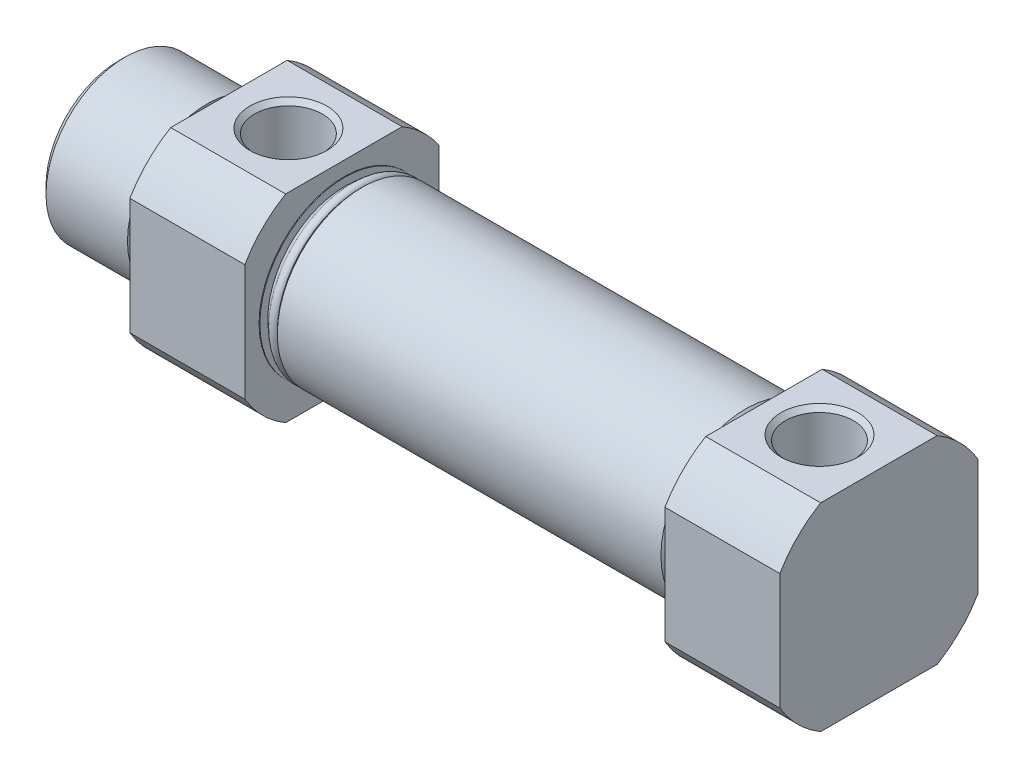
ISO-10303-21;
HEADER;
FILE_DESCRIPTION(('STEP AP214'),'2;1');
FILE_NAME('part.step','',(''),(''),'','','');
FILE_SCHEMA(('AUTOMOTIVE_DESIGN { 1 0 10303 214 1 1 1 1 }'));
ENDSEC;
DATA;
#1=APPLICATION_CONTEXT('core data for automotive mechanical design processes');
#2=APPLICATION_PROTOCOL_DEFINITION('international standard','automotive_design',2000,#1);
#3=PRODUCT_CONTEXT('',#1,'mechanical');
#4=PRODUCT('Part','Part','',(#3));
#5=PRODUCT_RELATED_PRODUCT_CATEGORY('part','',(#4));
#6=PRODUCT_DEFINITION_FORMATION('','',#4);
#7=PRODUCT_DEFINITION_CONTEXT('part definition',#1,'design');
#8=PRODUCT_DEFINITION('design','',#6,#7);
#9=PRODUCT_DEFINITION_SHAPE('','',#8);
#10=(LENGTH_UNIT() NAMED_UNIT(*) SI_UNIT(.MILLI.,.METRE.));
#11=(NAMED_UNIT(*) PLANE_ANGLE_UNIT() SI_UNIT($,.RADIAN.));
#12=(NAMED_UNIT(*) SI_UNIT($,.STERADIAN.) SOLID_ANGLE_UNIT());
#13=UNCERTAINTY_MEASURE_WITH_UNIT(LENGTH_MEASURE(1.E-05),#10,'distance_accuracy_value','');
#14=(GEOMETRIC_REPRESENTATION_CONTEXT(3) GLOBAL_UNCERTAINTY_ASSIGNED_CONTEXT((#13)) GLOBAL_UNIT_ASSIGNED_CONTEXT((#10,
#11,#12)) REPRESENTATION_CONTEXT('',''));
#15=CARTESIAN_POINT('',(0.,0.,0.));
#16=DIRECTION('',(0.,0.,1.));
#17=DIRECTION('',(1.,0.,0.));
#18=AXIS2_PLACEMENT_3D('',#15,#16,#17);
#19=CARTESIAN_POINT('',(67.5,10.7,0.));
#20=DIRECTION('',(1.,0.,0.));
#21=DIRECTION('',(0.,0.,-1.));
#22=AXIS2_PLACEMENT_3D('',#19,#20,#21);
#23=PLANE('',#22);
#24=CARTESIAN_POINT('',(67.5,0.,0.));
#25=DIRECTION('',(-1.,0.,0.));
#26=DIRECTION('',(0.,0.,1.));
#27=AXIS2_PLACEMENT_3D('',#24,#25,#26);
#28=CIRCLE('',#27,10.7);
#29=CARTESIAN_POINT('',(67.5,0.,10.7));
#30=VERTEX_POINT('',#29);
#31=EDGE_CURVE('E230',#30,#30,#28,.T.);
#32=ORIENTED_EDGE('',*,*,#31,.F.);
#33=EDGE_LOOP('',(#32));
#34=FACE_BOUND('',#33,.T.);
#35=DIRECTION('',(0.,0.,1.));
#36=VECTOR('',#35,1.);
#37=CARTESIAN_POINT('',(67.5,12.5,-7.34846922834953));
#38=LINE('',#37,#36);
#39=CARTESIAN_POINT('',(67.5,12.5,-7.34846922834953));
#40=VERTEX_POINT('',#39);
#41=CARTESIAN_POINT('',(67.5,12.5,7.34846922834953));
#42=VERTEX_POINT('',#41);
#43=EDGE_CURVE('E339',#40,#42,#38,.T.);
#44=ORIENTED_EDGE('',*,*,#43,.F.);
#45=CARTESIAN_POINT('',(67.5,0.,0.));
#46=DIRECTION('',(-1.,0.,0.));
#47=DIRECTION('',(0.,0.,1.));
#48=AXIS2_PLACEMENT_3D('',#45,#46,#47);
#49=CIRCLE('',#48,14.5);
#50=CARTESIAN_POINT('',(67.5,7.34846922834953,-12.5));
#51=VERTEX_POINT('',#50);
#52=EDGE_CURVE('E231',#40,#51,#49,.T.);
#53=ORIENTED_EDGE('',*,*,#52,.T.);
#54=DIRECTION('',(0.,1.,0.));
#55=VECTOR('',#54,1.);
#56=CARTESIAN_POINT('',(67.5,-7.34846922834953,-12.5));
#57=LINE('',#56,#55);
#58=CARTESIAN_POINT('',(67.5,-7.34846922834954,-12.5));
#59=VERTEX_POINT('',#58);
#60=EDGE_CURVE('E347',#59,#51,#57,.T.);
#61=ORIENTED_EDGE('',*,*,#60,.F.);
#62=CARTESIAN_POINT('',(67.5,-12.5,-7.34846922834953));
#63=VERTEX_POINT('',#62);
#64=EDGE_CURVE('E356',#59,#63,#49,.T.);
#65=ORIENTED_EDGE('',*,*,#64,.T.);
#66=DIRECTION('',(0.,0.,-1.));
#67=VECTOR('',#66,1.);
#68=CARTESIAN_POINT('',(67.5,-12.5,7.34846922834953));
#69=LINE('',#68,#67);
#70=CARTESIAN_POINT('',(67.5,-12.5,7.34846922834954));
#71=VERTEX_POINT('',#70);
#72=EDGE_CURVE('E363',#71,#63,#69,.T.);
#73=ORIENTED_EDGE('',*,*,#72,.F.);
#74=CARTESIAN_POINT('',(67.5,-7.34846922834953,12.5));
#75=VERTEX_POINT('',#74);
#76=EDGE_CURVE('E225',#71,#75,#49,.T.);
#77=ORIENTED_EDGE('',*,*,#76,.T.);
#78=DIRECTION('',(0.,-1.,0.));
#79=VECTOR('',#78,1.);
#80=CARTESIAN_POINT('',(67.5,7.34846922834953,12.5));
#81=LINE('',#80,#79);
#82=CARTESIAN_POINT('',(67.5,7.34846922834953,12.5));
#83=VERTEX_POINT('',#82);
#84=EDGE_CURVE('E362',#83,#75,#81,.T.);
#85=ORIENTED_EDGE('',*,*,#84,.F.);
#86=EDGE_CURVE('E227',#83,#42,#49,.T.);
#87=ORIENTED_EDGE('',*,*,#86,.T.);
#88=EDGE_LOOP('',(#44,#53,#61,#65,#73,#77,#85,#87));
#89=FACE_BOUND('',#88,.T.);
#90=ADVANCED_FACE('F16',(#34,#89),#23,.F.);
#91=CARTESIAN_POINT('',(82.,0.,0.));
#92=DIRECTION('',(-1.,0.,0.));
#93=DIRECTION('',(0.,0.,1.));
#94=AXIS2_PLACEMENT_3D('',#91,#92,#93);
#95=CYLINDRICAL_SURFACE('',#94,14.5);
#96=DIRECTION('',(1.,0.,0.));
#97=VECTOR('',#96,1.);
#98=CARTESIAN_POINT('',(67.5,12.5,-7.34846922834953));
#99=LINE('',#98,#97);
#100=CARTESIAN_POINT('',(82.,12.5,-7.34846922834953));
#101=VERTEX_POINT('',#100);
#102=EDGE_CURVE('E353',#40,#101,#99,.T.);
#103=ORIENTED_EDGE('',*,*,#102,.T.);
#104=CARTESIAN_POINT('',(82.,0.,0.));
#105=DIRECTION('',(-1.,0.,0.));
#106=DIRECTION('',(0.,0.,1.));
#107=AXIS2_PLACEMENT_3D('',#104,#105,#106);
#108=CIRCLE('',#107,14.5);
#109=CARTESIAN_POINT('',(82.,7.34846922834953,-12.5));
#110=VERTEX_POINT('',#109);
#111=EDGE_CURVE('E226',#101,#110,#108,.T.);
#112=ORIENTED_EDGE('',*,*,#111,.T.);
#113=DIRECTION('',(1.,0.,0.));
#114=VECTOR('',#113,1.);
#115=CARTESIAN_POINT('',(67.5,7.34846922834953,-12.5));
#116=LINE('',#115,#114);
#117=EDGE_CURVE('E355',#51,#110,#116,.T.);
#118=ORIENTED_EDGE('',*,*,#117,.F.);
#119=ORIENTED_EDGE('',*,*,#52,.F.);
#120=EDGE_LOOP('',(#103,#112,#118,#119));
#121=FACE_BOUND('',#120,.T.);
#122=ADVANCED_FACE('F335',(#121),#95,.T.);
#123=DIRECTION('',(1.,0.,0.));
#124=VECTOR('',#123,1.);
#125=CARTESIAN_POINT('',(67.5,12.5,7.34846922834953));
#126=LINE('',#125,#124);
#127=CARTESIAN_POINT('',(82.,12.5,7.34846922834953));
#128=VERTEX_POINT('',#127);
#129=EDGE_CURVE('E381',#42,#128,#126,.T.);
#130=ORIENTED_EDGE('',*,*,#129,.F.);
#131=ORIENTED_EDGE('',*,*,#86,.F.);
#132=DIRECTION('',(1.,0.,0.));
#133=VECTOR('',#132,1.);
#134=CARTESIAN_POINT('',(67.5,7.34846922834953,12.5));
#135=LINE('',#134,#133);
#136=CARTESIAN_POINT('',(82.,7.34846922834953,12.5));
#137=VERTEX_POINT('',#136);
#138=EDGE_CURVE('E346',#83,#137,#135,.T.);
#139=ORIENTED_EDGE('',*,*,#138,.T.);
#140=EDGE_CURVE('E222',#137,#128,#108,.T.);
#141=ORIENTED_EDGE('',*,*,#140,.T.);
#142=EDGE_LOOP('',(#130,#131,#139,#141));
#143=FACE_BOUND('',#142,.T.);
#144=ADVANCED_FACE('F503',(#143),#95,.T.);
#145=DIRECTION('',(1.,0.,0.));
#146=VECTOR('',#145,1.);
#147=CARTESIAN_POINT('',(67.5,-7.34846922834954,-12.5));
#148=LINE('',#147,#146);
#149=CARTESIAN_POINT('',(82.,-7.34846922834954,-12.5));
#150=VERTEX_POINT('',#149);
#151=EDGE_CURVE('E391',#59,#150,#148,.T.);
#152=ORIENTED_EDGE('',*,*,#151,.T.);
#153=CARTESIAN_POINT('',(82.,-12.5,-7.34846922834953));
#154=VERTEX_POINT('',#153);
#155=EDGE_CURVE('E404',#150,#154,#108,.T.);
#156=ORIENTED_EDGE('',*,*,#155,.T.);
#157=DIRECTION('',(1.,0.,0.));
#158=VECTOR('',#157,1.);
#159=CARTESIAN_POINT('',(67.5,-12.5,-7.34846922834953));
#160=LINE('',#159,#158);
#161=EDGE_CURVE('E371',#63,#154,#160,.T.);
#162=ORIENTED_EDGE('',*,*,#161,.F.);
#163=ORIENTED_EDGE('',*,*,#64,.F.);
#164=EDGE_LOOP('',(#152,#156,#162,#163));
#165=FACE_BOUND('',#164,.T.);
#166=ADVANCED_FACE('F408',(#165),#95,.T.);
#167=DIRECTION('',(1.,0.,0.));
#168=VECTOR('',#167,1.);
#169=CARTESIAN_POINT('',(67.5,-12.5,7.34846922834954));
#170=LINE('',#169,#168);
#171=CARTESIAN_POINT('',(82.,-12.5,7.34846922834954));
#172=VERTEX_POINT('',#171);
#173=EDGE_CURVE('E368',#71,#172,#170,.T.);
#174=ORIENTED_EDGE('',*,*,#173,.T.);
#175=CARTESIAN_POINT('',(82.,-7.34846922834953,12.5));
#176=VERTEX_POINT('',#175);
#177=EDGE_CURVE('E221',#172,#176,#108,.T.);
#178=ORIENTED_EDGE('',*,*,#177,.T.);
#179=DIRECTION('',(1.,0.,0.));
#180=VECTOR('',#179,1.);
#181=CARTESIAN_POINT('',(67.5,-7.34846922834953,12.5));
#182=LINE('',#181,#180);
#183=EDGE_CURVE('E38',#75,#176,#182,.T.);
#184=ORIENTED_EDGE('',*,*,#183,.F.);
#185=ORIENTED_EDGE('',*,*,#76,.F.);
#186=EDGE_LOOP('',(#174,#178,#184,#185));
#187=FACE_BOUND('',#186,.T.);
#188=ADVANCED_FACE('F366',(#187),#95,.T.);
#189=CARTESIAN_POINT('',(82.,14.5,0.));
#190=DIRECTION('',(-1.,0.,0.));
#191=DIRECTION('',(0.,0.,1.));
#192=AXIS2_PLACEMENT_3D('',#189,#190,#191);
#193=PLANE('',#192);
#194=DIRECTION('',(0.,0.,1.));
#195=VECTOR('',#194,1.);
#196=CARTESIAN_POINT('',(82.,12.5,-7.34846922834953));
#197=LINE('',#196,#195);
#198=EDGE_CURVE('E387',#101,#128,#197,.T.);
#199=ORIENTED_EDGE('',*,*,#198,.T.);
#200=ORIENTED_EDGE('',*,*,#140,.F.);
#201=DIRECTION('',(0.,-1.,0.));
#202=VECTOR('',#201,1.);
#203=CARTESIAN_POINT('',(82.,7.34846922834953,12.5));
#204=LINE('',#203,#202);
#205=EDGE_CURVE('E406',#137,#176,#204,.T.);
#206=ORIENTED_EDGE('',*,*,#205,.T.);
#207=ORIENTED_EDGE('',*,*,#177,.F.);
#208=DIRECTION('',(0.,0.,-1.));
#209=VECTOR('',#208,1.);
#210=CARTESIAN_POINT('',(82.,-12.5,7.34846922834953));
#211=LINE('',#210,#209);
#212=EDGE_CURVE('E397',#172,#154,#211,.T.);
#213=ORIENTED_EDGE('',*,*,#212,.T.);
#214=ORIENTED_EDGE('',*,*,#155,.F.);
#215=DIRECTION('',(0.,1.,0.));
#216=VECTOR('',#215,1.);
#217=CARTESIAN_POINT('',(82.,-7.34846922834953,-12.5));
#218=LINE('',#217,#216);
#219=EDGE_CURVE('E405',#150,#110,#218,.T.);
#220=ORIENTED_EDGE('',*,*,#219,.T.);
#221=ORIENTED_EDGE('',*,*,#111,.F.);
#222=EDGE_LOOP('',(#199,#200,#206,#207,#213,#214,#220,#221));
#223=FACE_BOUND('',#222,.T.);
#224=ADVANCED_FACE('F402',(#223),#193,.F.);
#225=CARTESIAN_POINT('',(82.,0.,0.));
#226=DIRECTION('',(-1.,0.,0.));
#227=DIRECTION('',(0.,0.,1.));
#228=AXIS2_PLACEMENT_3D('',#225,#226,#227);
#229=CYLINDRICAL_SURFACE('',#228,14.5);
#230=CARTESIAN_POINT('',(14.5,0.,0.));
#231=DIRECTION('',(-1.,0.,0.));
#232=DIRECTION('',(0.,0.,1.));
#233=AXIS2_PLACEMENT_3D('',#230,#231,#232);
#234=CIRCLE('',#233,14.5);
#235=CARTESIAN_POINT('',(14.5,-12.5,7.34846922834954));
#236=VERTEX_POINT('',#235);
#237=CARTESIAN_POINT('',(14.5,-7.34846922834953,12.5));
#238=VERTEX_POINT('',#237);
#239=EDGE_CURVE('E157',#236,#238,#234,.T.);
#240=ORIENTED_EDGE('',*,*,#239,.T.);
#241=DIRECTION('',(-1.,0.,0.));
#242=VECTOR('',#241,1.);
#243=CARTESIAN_POINT('',(14.5,-7.34846922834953,12.5));
#244=LINE('',#243,#242);
#245=CARTESIAN_POINT('',(0.,-7.34846922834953,12.5));
#246=VERTEX_POINT('',#245);
#247=EDGE_CURVE('E216',#238,#246,#244,.T.);
#248=ORIENTED_EDGE('',*,*,#247,.T.);
#249=CARTESIAN_POINT('',(0.,0.,0.));
#250=DIRECTION('',(-1.,0.,0.));
#251=DIRECTION('',(0.,0.,1.));
#252=AXIS2_PLACEMENT_3D('',#249,#250,#251);
#253=CIRCLE('',#252,14.5);
#254=CARTESIAN_POINT('',(0.,-12.5,7.34846922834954));
#255=VERTEX_POINT('',#254);
#256=EDGE_CURVE('E165',#255,#246,#253,.T.);
#257=ORIENTED_EDGE('',*,*,#256,.F.);
#258=DIRECTION('',(-1.,0.,0.));
#259=VECTOR('',#258,1.);
#260=CARTESIAN_POINT('',(14.5,-12.5,7.34846922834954));
#261=LINE('',#260,#259);
#262=EDGE_CURVE('E214',#236,#255,#261,.T.);
#263=ORIENTED_EDGE('',*,*,#262,.F.);
#264=EDGE_LOOP('',(#240,#248,#257,#263));
#265=FACE_BOUND('',#264,.T.);
#266=ADVANCED_FACE('F501',(#265),#229,.T.);
#267=DIRECTION('',(-1.,0.,0.));
#268=VECTOR('',#267,1.);
#269=CARTESIAN_POINT('',(14.5,-7.34846922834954,-12.5));
#270=LINE('',#269,#268);
#271=CARTESIAN_POINT('',(14.,-7.34846922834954,-12.5));
#272=VERTEX_POINT('',#271);
#273=CARTESIAN_POINT('',(0.,-7.34846922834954,-12.5));
#274=VERTEX_POINT('',#273);
#275=EDGE_CURVE('E148',#272,#274,#270,.T.);
#276=ORIENTED_EDGE('',*,*,#275,.F.);
#277=CARTESIAN_POINT('',(26.5,0.,0.));
#278=DIRECTION('',(-0.707106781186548,0.,0.707106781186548));
#279=DIRECTION('',(-0.707106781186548,0.,-0.707106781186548));
#280=AXIS2_PLACEMENT_3D('',#277,#278,#279);
#281=ELLIPSE('',#280,20.5060966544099,14.5);
#282=CARTESIAN_POINT('',(14.5,-8.13941029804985,-12.));
#283=VERTEX_POINT('',#282);
#284=EDGE_CURVE('E31',#272,#283,#281,.T.);
#285=ORIENTED_EDGE('',*,*,#284,.T.);
#286=CARTESIAN_POINT('',(14.5,-12.5,-7.34846922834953));
#287=VERTEX_POINT('',#286);
#288=EDGE_CURVE('E145',#283,#287,#234,.T.);
#289=ORIENTED_EDGE('',*,*,#288,.T.);
#290=DIRECTION('',(-1.,0.,0.));
#291=VECTOR('',#290,1.);
#292=CARTESIAN_POINT('',(14.5,-12.5,-7.34846922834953));
#293=LINE('',#292,#291);
#294=CARTESIAN_POINT('',(0.,-12.5,-7.34846922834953));
#295=VERTEX_POINT('',#294);
#296=EDGE_CURVE('E212',#287,#295,#293,.T.);
#297=ORIENTED_EDGE('',*,*,#296,.T.);
#298=EDGE_CURVE('E171',#274,#295,#253,.T.);
#299=ORIENTED_EDGE('',*,*,#298,.F.);
#300=EDGE_LOOP('',(#276,#285,#289,#297,#299));
#301=FACE_BOUND('',#300,.T.);
#302=ADVANCED_FACE('F143',(#301),#229,.T.);
#303=CARTESIAN_POINT('',(14.5,12.5,-7.34846922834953));
#304=VERTEX_POINT('',#303);
#305=CARTESIAN_POINT('',(14.5,8.13941029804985,-12.));
#306=VERTEX_POINT('',#305);
#307=EDGE_CURVE('E156',#304,#306,#234,.T.);
#308=ORIENTED_EDGE('',*,*,#307,.T.);
#309=CARTESIAN_POINT('',(26.5,0.,0.));
#310=DIRECTION('',(-0.707106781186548,0.,0.707106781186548));
#311=DIRECTION('',(-0.707106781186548,0.,-0.707106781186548));
#312=AXIS2_PLACEMENT_3D('',#309,#310,#311);
#313=ELLIPSE('',#312,20.5060966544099,14.5);
#314=CARTESIAN_POINT('',(14.,7.34846922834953,-12.5));
#315=VERTEX_POINT('',#314);
#316=EDGE_CURVE('E135',#306,#315,#313,.T.);
#317=ORIENTED_EDGE('',*,*,#316,.T.);
#318=DIRECTION('',(-1.,0.,0.));
#319=VECTOR('',#318,1.);
#320=CARTESIAN_POINT('',(14.5,7.34846922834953,-12.5));
#321=LINE('',#320,#319);
#322=CARTESIAN_POINT('',(0.,7.34846922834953,-12.5));
#323=VERTEX_POINT('',#322);
#324=EDGE_CURVE('E195',#315,#323,#321,.T.);
#325=ORIENTED_EDGE('',*,*,#324,.T.);
#326=CARTESIAN_POINT('',(0.,12.5,-7.34846922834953));
#327=VERTEX_POINT('',#326);
#328=EDGE_CURVE('E178',#327,#323,#253,.T.);
#329=ORIENTED_EDGE('',*,*,#328,.F.);
#330=DIRECTION('',(-1.,0.,0.));
#331=VECTOR('',#330,1.);
#332=CARTESIAN_POINT('',(14.5,12.5,-7.34846922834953));
#333=LINE('',#332,#331);
#334=EDGE_CURVE('E193',#304,#327,#333,.T.);
#335=ORIENTED_EDGE('',*,*,#334,.F.);
#336=EDGE_LOOP('',(#308,#317,#325,#329,#335));
#337=FACE_BOUND('',#336,.T.);
#338=ADVANCED_FACE('F192',(#337),#229,.T.);
#339=CARTESIAN_POINT('',(0.,0.,0.));
#340=DIRECTION('',(1.,0.,0.));
#341=DIRECTION('',(0.,0.,-1.));
#342=AXIS2_PLACEMENT_3D('',#339,#340,#341);
#343=PLANE('',#342);
#344=CARTESIAN_POINT('',(0.,0.,0.));
#345=DIRECTION('',(1.,0.,0.));
#346=DIRECTION('',(0.,0.,-1.));
#347=AXIS2_PLACEMENT_3D('',#344,#345,#346);
#348=CIRCLE('',#347,10.);
#349=CARTESIAN_POINT('',(0.,0.,-10.));
#350=VERTEX_POINT('',#349);
#351=EDGE_CURVE('E24',#350,#350,#348,.F.);
#352=ORIENTED_EDGE('',*,*,#351,.F.);
#353=EDGE_LOOP('',(#352));
#354=FACE_BOUND('',#353,.T.);
#355=ORIENTED_EDGE('',*,*,#256,.T.);
#356=DIRECTION('',(0.,-1.,0.));
#357=VECTOR('',#356,1.);
#358=CARTESIAN_POINT('',(0.,7.34846922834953,12.5));
#359=LINE('',#358,#357);
#360=CARTESIAN_POINT('',(0.,7.34846922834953,12.5));
#361=VERTEX_POINT('',#360);
#362=EDGE_CURVE('E203',#361,#246,#359,.T.);
#363=ORIENTED_EDGE('',*,*,#362,.F.);
#364=CARTESIAN_POINT('',(0.,12.5,7.34846922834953));
#365=VERTEX_POINT('',#364);
#366=EDGE_CURVE('E172',#361,#365,#253,.T.);
#367=ORIENTED_EDGE('',*,*,#366,.T.);
#368=DIRECTION('',(0.,0.,1.));
#369=VECTOR('',#368,1.);
#370=CARTESIAN_POINT('',(0.,12.5,-7.34846922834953));
#371=LINE('',#370,#369);
#372=EDGE_CURVE('E189',#327,#365,#371,.T.);
#373=ORIENTED_EDGE('',*,*,#372,.F.);
#374=ORIENTED_EDGE('',*,*,#328,.T.);
#375=DIRECTION('',(0.,1.,0.));
#376=VECTOR('',#375,1.);
#377=CARTESIAN_POINT('',(0.,-7.34846922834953,-12.5));
#378=LINE('',#377,#376);
#379=EDGE_CURVE('E188',#274,#323,#378,.T.);
#380=ORIENTED_EDGE('',*,*,#379,.F.);
#381=ORIENTED_EDGE('',*,*,#298,.T.);
#382=DIRECTION('',(0.,0.,-1.));
#383=VECTOR('',#382,1.);
#384=CARTESIAN_POINT('',(0.,-12.5,7.34846922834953));
#385=LINE('',#384,#383);
#386=EDGE_CURVE('E199',#255,#295,#385,.T.);
#387=ORIENTED_EDGE('',*,*,#386,.F.);
#388=EDGE_LOOP('',(#355,#363,#367,#373,#374,#380,#381,#387));
#389=FACE_BOUND('',#388,.T.);
#390=ADVANCED_FACE('F18',(#354,#389),#343,.F.);
#391=ORIENTED_EDGE('',*,*,#366,.F.);
#392=DIRECTION('',(-1.,0.,0.));
#393=VECTOR('',#392,1.);
#394=CARTESIAN_POINT('',(14.5,7.34846922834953,12.5));
#395=LINE('',#394,#393);
#396=CARTESIAN_POINT('',(14.5,7.34846922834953,12.5));
#397=VERTEX_POINT('',#396);
#398=EDGE_CURVE('E219',#397,#361,#395,.T.);
#399=ORIENTED_EDGE('',*,*,#398,.F.);
#400=CARTESIAN_POINT('',(14.5,12.5,7.34846922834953));
#401=VERTEX_POINT('',#400);
#402=EDGE_CURVE('E159',#397,#401,#234,.T.);
#403=ORIENTED_EDGE('',*,*,#402,.T.);
#404=DIRECTION('',(-1.,0.,0.));
#405=VECTOR('',#404,1.);
#406=CARTESIAN_POINT('',(14.5,12.5,7.34846922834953));
#407=LINE('',#406,#405);
#408=EDGE_CURVE('E207',#401,#365,#407,.T.);
#409=ORIENTED_EDGE('',*,*,#408,.T.);
#410=EDGE_LOOP('',(#391,#399,#403,#409));
#411=FACE_BOUND('',#410,.T.);
#412=ADVANCED_FACE('F506',(#411),#229,.T.);
#413=CARTESIAN_POINT('',(14.5,14.5,0.));
#414=DIRECTION('',(-1.,0.,0.));
#415=DIRECTION('',(0.,0.,1.));
#416=AXIS2_PLACEMENT_3D('',#413,#414,#415);
#417=PLANE('',#416);
#418=ORIENTED_EDGE('',*,*,#288,.F.);
#419=DIRECTION('',(0.,1.,0.));
#420=VECTOR('',#419,1.);
#421=CARTESIAN_POINT('',(14.5,-12.5,-12.));
#422=LINE('',#421,#420);
#423=EDGE_CURVE('E132',#283,#306,#422,.T.);
#424=ORIENTED_EDGE('',*,*,#423,.T.);
#425=ORIENTED_EDGE('',*,*,#307,.F.);
#426=DIRECTION('',(0.,0.,1.));
#427=VECTOR('',#426,1.);
#428=CARTESIAN_POINT('',(14.5,12.5,-7.34846922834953));
#429=LINE('',#428,#427);
#430=EDGE_CURVE('E209',#304,#401,#429,.T.);
#431=ORIENTED_EDGE('',*,*,#430,.T.);
#432=ORIENTED_EDGE('',*,*,#402,.F.);
#433=DIRECTION('',(0.,-1.,0.));
#434=VECTOR('',#433,1.);
#435=CARTESIAN_POINT('',(14.5,7.34846922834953,12.5));
#436=LINE('',#435,#434);
#437=EDGE_CURVE('E201',#397,#238,#436,.T.);
#438=ORIENTED_EDGE('',*,*,#437,.T.);
#439=ORIENTED_EDGE('',*,*,#239,.F.);
#440=DIRECTION('',(0.,0.,-1.));
#441=VECTOR('',#440,1.);
#442=CARTESIAN_POINT('',(14.5,-12.5,7.34846922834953));
#443=LINE('',#442,#441);
#444=EDGE_CURVE('E155',#236,#287,#443,.T.);
#445=ORIENTED_EDGE('',*,*,#444,.T.);
#446=EDGE_LOOP('',(#418,#424,#425,#431,#432,#438,#439,#445));
#447=FACE_BOUND('',#446,.T.);
#448=CARTESIAN_POINT('',(14.5,0.,0.));
#449=DIRECTION('',(-1.,0.,0.));
#450=DIRECTION('',(0.,0.,1.));
#451=AXIS2_PLACEMENT_3D('',#448,#449,#450);
#452=CIRCLE('',#451,10.7);
#453=CARTESIAN_POINT('',(14.5,0.,10.7));
#454=VERTEX_POINT('',#453);
#455=EDGE_CURVE('E161',#454,#454,#452,.T.);
#456=ORIENTED_EDGE('',*,*,#455,.T.);
#457=EDGE_LOOP('',(#456));
#458=FACE_BOUND('',#457,.T.);
#459=ADVANCED_FACE('F152',(#447,#458),#417,.F.);
#460=CARTESIAN_POINT('',(82.,0.,0.));
#461=DIRECTION('',(-1.,0.,0.));
#462=DIRECTION('',(0.,0.,1.));
#463=AXIS2_PLACEMENT_3D('',#460,#461,#462);
#464=CYLINDRICAL_SURFACE('',#463,10.7);
#465=ORIENTED_EDGE('',*,*,#455,.F.);
#466=EDGE_LOOP('',(#465));
#467=FACE_BOUND('',#466,.T.);
#468=CARTESIAN_POINT('',(14.6,0.,0.));
#469=DIRECTION('',(-1.,0.,0.));
#470=DIRECTION('',(0.,0.,1.));
#471=AXIS2_PLACEMENT_3D('',#468,#469,#470);
#472=CIRCLE('',#471,10.7);
#473=CARTESIAN_POINT('',(14.6,0.,10.7));
#474=VERTEX_POINT('',#473);
#475=EDGE_CURVE('E261',#474,#474,#472,.T.);
#476=ORIENTED_EDGE('',*,*,#475,.T.);
#477=EDGE_LOOP('',(#476));
#478=FACE_BOUND('',#477,.T.);
#479=ADVANCED_FACE('F266',(#467,#478),#464,.T.);
#480=CARTESIAN_POINT('',(14.6,10.7,0.));
#481=DIRECTION('',(-1.,0.,0.));
#482=DIRECTION('',(0.,0.,1.));
#483=AXIS2_PLACEMENT_3D('',#480,#481,#482);
#484=PLANE('',#483);
#485=ORIENTED_EDGE('',*,*,#475,.F.);
#486=EDGE_LOOP('',(#485));
#487=FACE_BOUND('',#486,.T.);
#488=CARTESIAN_POINT('',(14.6,0.,0.));
#489=DIRECTION('',(-1.,0.,0.));
#490=DIRECTION('',(0.,0.,1.));
#491=AXIS2_PLACEMENT_3D('',#488,#489,#490);
#492=CIRCLE('',#491,9.7);
#493=CARTESIAN_POINT('',(14.6,0.,9.7));
#494=VERTEX_POINT('',#493);
#495=EDGE_CURVE('E258',#494,#494,#492,.T.);
#496=ORIENTED_EDGE('',*,*,#495,.T.);
#497=EDGE_LOOP('',(#496));
#498=FACE_BOUND('',#497,.T.);
#499=ADVANCED_FACE('F269',(#487,#498),#484,.F.);
#500=CARTESIAN_POINT('',(15.5,0.,0.));
#501=DIRECTION('',(1.,0.,0.));
#502=DIRECTION('',(0.,0.,-1.));
#503=AXIS2_PLACEMENT_3D('',#500,#501,#502);
#504=CONICAL_SURFACE('',#503,10.5,0.726642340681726);
#505=ORIENTED_EDGE('',*,*,#495,.F.);
#506=EDGE_LOOP('',(#505));
#507=FACE_BOUND('',#506,.T.);
#508=CARTESIAN_POINT('',(15.5,0.,0.));
#509=DIRECTION('',(-1.,0.,0.));
#510=DIRECTION('',(0.,0.,1.));
#511=AXIS2_PLACEMENT_3D('',#508,#509,#510);
#512=CIRCLE('',#511,10.5);
#513=CARTESIAN_POINT('',(15.5,0.,10.5));
#514=VERTEX_POINT('',#513);
#515=EDGE_CURVE('E255',#514,#514,#512,.T.);
#516=ORIENTED_EDGE('',*,*,#515,.T.);
#517=EDGE_LOOP('',(#516));
#518=FACE_BOUND('',#517,.T.);
#519=ADVANCED_FACE('F275',(#507,#518),#504,.T.);
#520=CARTESIAN_POINT('',(15.962,0.,0.));
#521=DIRECTION('',(-1.,0.,0.));
#522=DIRECTION('',(0.,0.,1.));
#523=AXIS2_PLACEMENT_3D('',#520,#521,#522);
#524=TOROIDAL_SURFACE('',#523,10.07,0.631144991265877);
#525=ORIENTED_EDGE('',*,*,#515,.F.);
#526=EDGE_LOOP('',(#525));
#527=FACE_BOUND('',#526,.T.);
#528=CARTESIAN_POINT('',(16.5,0.,0.));
#529=DIRECTION('',(-1.,0.,0.));
#530=DIRECTION('',(0.,0.,1.));
#531=AXIS2_PLACEMENT_3D('',#528,#529,#530);
#532=CIRCLE('',#531,10.4);
#533=CARTESIAN_POINT('',(16.5,0.,10.4));
#534=VERTEX_POINT('',#533);
#535=EDGE_CURVE('E252',#534,#534,#532,.T.);
#536=ORIENTED_EDGE('',*,*,#535,.T.);
#537=EDGE_LOOP('',(#536));
#538=FACE_BOUND('',#537,.T.);
#539=ADVANCED_FACE('F281',(#527,#538),#524,.T.);
#540=CARTESIAN_POINT('',(16.8,0.,0.));
#541=DIRECTION('',(1.,0.,0.));
#542=DIRECTION('',(0.,0.,-1.));
#543=AXIS2_PLACEMENT_3D('',#540,#541,#542);
#544=CONICAL_SURFACE('',#543,10.7,0.78539816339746);
#545=ORIENTED_EDGE('',*,*,#535,.F.);
#546=EDGE_LOOP('',(#545));
#547=FACE_BOUND('',#546,.T.);
#548=CARTESIAN_POINT('',(16.8,0.,0.));
#549=DIRECTION('',(-1.,0.,0.));
#550=DIRECTION('',(0.,0.,1.));
#551=AXIS2_PLACEMENT_3D('',#548,#549,#550);
#552=CIRCLE('',#551,10.7);
#553=CARTESIAN_POINT('',(16.8,0.,10.7));
#554=VERTEX_POINT('',#553);
#555=EDGE_CURVE('E249',#554,#554,#552,.T.);
#556=ORIENTED_EDGE('',*,*,#555,.T.);
#557=EDGE_LOOP('',(#556));
#558=FACE_BOUND('',#557,.T.);
#559=ADVANCED_FACE('F287',(#547,#558),#544,.T.);
#560=CARTESIAN_POINT('',(82.,0.,0.));
#561=DIRECTION('',(-1.,0.,0.));
#562=DIRECTION('',(0.,0.,1.));
#563=AXIS2_PLACEMENT_3D('',#560,#561,#562);
#564=CYLINDRICAL_SURFACE('',#563,10.7);
#565=ORIENTED_EDGE('',*,*,#555,.F.);
#566=EDGE_LOOP('',(#565));
#567=FACE_BOUND('',#566,.T.);
#568=CARTESIAN_POINT('',(65.2,0.,0.));
#569=DIRECTION('',(-1.,0.,0.));
#570=DIRECTION('',(0.,0.,1.));
#571=AXIS2_PLACEMENT_3D('',#568,#569,#570);
#572=CIRCLE('',#571,10.7);
#573=CARTESIAN_POINT('',(65.2,0.,10.7));
#574=VERTEX_POINT('',#573);
#575=EDGE_CURVE('E246',#574,#574,#572,.T.);
#576=ORIENTED_EDGE('',*,*,#575,.T.);
#577=EDGE_LOOP('',(#576));
#578=FACE_BOUND('',#577,.T.);
#579=ADVANCED_FACE('F293',(#567,#578),#564,.T.);
#580=CARTESIAN_POINT('',(65.5,0.,0.));
#581=DIRECTION('',(-1.,0.,0.));
#582=DIRECTION('',(0.,0.,1.));
#583=AXIS2_PLACEMENT_3D('',#580,#581,#582);
#584=CONICAL_SURFACE('',#583,10.4,0.785398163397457);
#585=ORIENTED_EDGE('',*,*,#575,.F.);
#586=EDGE_LOOP('',(#585));
#587=FACE_BOUND('',#586,.T.);
#588=CARTESIAN_POINT('',(65.5,0.,0.));
#589=DIRECTION('',(-1.,0.,0.));
#590=DIRECTION('',(0.,0.,1.));
#591=AXIS2_PLACEMENT_3D('',#588,#589,#590);
#592=CIRCLE('',#591,10.4);
#593=CARTESIAN_POINT('',(65.5,0.,10.4));
#594=VERTEX_POINT('',#593);
#595=EDGE_CURVE('E243',#594,#594,#592,.T.);
#596=ORIENTED_EDGE('',*,*,#595,.T.);
#597=EDGE_LOOP('',(#596));
#598=FACE_BOUND('',#597,.T.);
#599=ADVANCED_FACE('F299',(#587,#598),#584,.T.);
#600=CARTESIAN_POINT('',(66.038,0.,0.));
#601=DIRECTION('',(-1.,0.,0.));
#602=DIRECTION('',(0.,0.,1.));
#603=AXIS2_PLACEMENT_3D('',#600,#601,#602);
#604=TOROIDAL_SURFACE('',#603,10.07,0.631144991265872);
#605=ORIENTED_EDGE('',*,*,#595,.F.);
#606=EDGE_LOOP('',(#605));
#607=FACE_BOUND('',#606,.T.);
#608=CARTESIAN_POINT('',(66.5,0.,0.));
#609=DIRECTION('',(-1.,0.,0.));
#610=DIRECTION('',(0.,0.,1.));
#611=AXIS2_PLACEMENT_3D('',#608,#609,#610);
#612=CIRCLE('',#611,10.5);
#613=CARTESIAN_POINT('',(66.5,0.,10.5));
#614=VERTEX_POINT('',#613);
#615=EDGE_CURVE('E240',#614,#614,#612,.T.);
#616=ORIENTED_EDGE('',*,*,#615,.T.);
#617=EDGE_LOOP('',(#616));
#618=FACE_BOUND('',#617,.T.);
#619=ADVANCED_FACE('F305',(#607,#618),#604,.T.);
#620=CARTESIAN_POINT('',(67.4,0.,0.));
#621=DIRECTION('',(-1.,0.,0.));
#622=DIRECTION('',(0.,0.,1.));
#623=AXIS2_PLACEMENT_3D('',#620,#621,#622);
#624=CONICAL_SURFACE('',#623,9.7,0.726642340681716);
#625=ORIENTED_EDGE('',*,*,#615,.F.);
#626=EDGE_LOOP('',(#625));
#627=FACE_BOUND('',#626,.T.);
#628=CARTESIAN_POINT('',(67.4,0.,0.));
#629=DIRECTION('',(-1.,0.,0.));
#630=DIRECTION('',(0.,0.,1.));
#631=AXIS2_PLACEMENT_3D('',#628,#629,#630);
#632=CIRCLE('',#631,9.7);
#633=CARTESIAN_POINT('',(67.4,0.,9.7));
#634=VERTEX_POINT('',#633);
#635=EDGE_CURVE('E237',#634,#634,#632,.T.);
#636=ORIENTED_EDGE('',*,*,#635,.T.);
#637=EDGE_LOOP('',(#636));
#638=FACE_BOUND('',#637,.T.);
#639=ADVANCED_FACE('F311',(#627,#638),#624,.T.);
#640=CARTESIAN_POINT('',(67.4,9.7,0.));
#641=DIRECTION('',(1.,0.,0.));
#642=DIRECTION('',(0.,0.,-1.));
#643=AXIS2_PLACEMENT_3D('',#640,#641,#642);
#644=PLANE('',#643);
#645=ORIENTED_EDGE('',*,*,#635,.F.);
#646=EDGE_LOOP('',(#645));
#647=FACE_BOUND('',#646,.T.);
#648=CARTESIAN_POINT('',(67.4,0.,0.));
#649=DIRECTION('',(-1.,0.,0.));
#650=DIRECTION('',(0.,0.,1.));
#651=AXIS2_PLACEMENT_3D('',#648,#649,#650);
#652=CIRCLE('',#651,10.7);
#653=CARTESIAN_POINT('',(67.4,0.,10.7));
#654=VERTEX_POINT('',#653);
#655=EDGE_CURVE('E234',#654,#654,#652,.T.);
#656=ORIENTED_EDGE('',*,*,#655,.T.);
#657=EDGE_LOOP('',(#656));
#658=FACE_BOUND('',#657,.T.);
#659=ADVANCED_FACE('F317',(#647,#658),#644,.F.);
#660=CARTESIAN_POINT('',(82.,0.,0.));
#661=DIRECTION('',(-1.,0.,0.));
#662=DIRECTION('',(0.,0.,1.));
#663=AXIS2_PLACEMENT_3D('',#660,#661,#662);
#664=CYLINDRICAL_SURFACE('',#663,10.7);
#665=ORIENTED_EDGE('',*,*,#655,.F.);
#666=EDGE_LOOP('',(#665));
#667=FACE_BOUND('',#666,.T.);
#668=ORIENTED_EDGE('',*,*,#31,.T.);
#669=EDGE_LOOP('',(#668));
#670=FACE_BOUND('',#669,.T.);
#671=ADVANCED_FACE('F323',(#667,#670),#664,.T.);
#672=CARTESIAN_POINT('',(14.5,12.5,-7.34846922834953));
#673=DIRECTION('',(0.,-1.,0.));
#674=DIRECTION('',(0.,0.,-1.));
#675=AXIS2_PLACEMENT_3D('',#672,#673,#674);
#676=PLANE('',#675);
#677=CARTESIAN_POINT('',(7.5,12.5,0.));
#678=DIRECTION('',(0.,1.,0.));
#679=DIRECTION('',(0.,0.,1.));
#680=AXIS2_PLACEMENT_3D('',#677,#678,#679);
#681=CIRCLE('',#680,4.864);
#682=CARTESIAN_POINT('',(7.5,12.5,4.864));
#683=VERTEX_POINT('',#682);
#684=EDGE_CURVE('E450',#683,#683,#681,.T.);
#685=ORIENTED_EDGE('',*,*,#684,.F.);
#686=EDGE_LOOP('',(#685));
#687=FACE_BOUND('',#686,.T.);
#688=ORIENTED_EDGE('',*,*,#372,.T.);
#689=ORIENTED_EDGE('',*,*,#408,.F.);
#690=ORIENTED_EDGE('',*,*,#430,.F.);
#691=ORIENTED_EDGE('',*,*,#334,.T.);
#692=EDGE_LOOP('',(#688,#689,#690,#691));
#693=FACE_BOUND('',#692,.T.);
#694=ADVANCED_FACE('F329',(#687,#693),#676,.F.);
#695=CARTESIAN_POINT('',(14.5,-7.34846922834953,-12.5));
#696=DIRECTION('',(0.,0.,1.));
#697=DIRECTION('',(1.,0.,0.));
#698=AXIS2_PLACEMENT_3D('',#695,#696,#697);
#699=PLANE('',#698);
#700=ORIENTED_EDGE('',*,*,#324,.F.);
#701=DIRECTION('',(0.,-1.,0.));
#702=VECTOR('',#701,1.);
#703=CARTESIAN_POINT('',(14.,-7.34846922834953,-12.5));
#704=LINE('',#703,#702);
#705=EDGE_CURVE('E11',#315,#272,#704,.T.);
#706=ORIENTED_EDGE('',*,*,#705,.T.);
#707=ORIENTED_EDGE('',*,*,#275,.T.);
#708=ORIENTED_EDGE('',*,*,#379,.T.);
#709=EDGE_LOOP('',(#700,#706,#707,#708));
#710=FACE_BOUND('',#709,.T.);
#711=ADVANCED_FACE('F198',(#710),#699,.F.);
#712=CARTESIAN_POINT('',(14.5,-12.5,7.34846922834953));
#713=DIRECTION('',(0.,1.,0.));
#714=DIRECTION('',(0.,0.,1.));
#715=AXIS2_PLACEMENT_3D('',#712,#713,#714);
#716=PLANE('',#715);
#717=ORIENTED_EDGE('',*,*,#386,.T.);
#718=ORIENTED_EDGE('',*,*,#296,.F.);
#719=ORIENTED_EDGE('',*,*,#444,.F.);
#720=ORIENTED_EDGE('',*,*,#262,.T.);
#721=EDGE_LOOP('',(#717,#718,#719,#720));
#722=FACE_BOUND('',#721,.T.);
#723=ADVANCED_FACE('F493',(#722),#716,.F.);
#724=CARTESIAN_POINT('',(14.5,7.34846922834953,12.5));
#725=DIRECTION('',(0.,0.,-1.));
#726=DIRECTION('',(-1.,0.,0.));
#727=AXIS2_PLACEMENT_3D('',#724,#725,#726);
#728=PLANE('',#727);
#729=ORIENTED_EDGE('',*,*,#362,.T.);
#730=ORIENTED_EDGE('',*,*,#247,.F.);
#731=ORIENTED_EDGE('',*,*,#437,.F.);
#732=ORIENTED_EDGE('',*,*,#398,.T.);
#733=EDGE_LOOP('',(#729,#730,#731,#732));
#734=FACE_BOUND('',#733,.T.);
#735=ADVANCED_FACE('F487',(#734),#728,.F.);
#736=CARTESIAN_POINT('',(67.5,7.34846922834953,12.5));
#737=DIRECTION('',(0.,0.,1.));
#738=DIRECTION('',(1.,0.,0.));
#739=AXIS2_PLACEMENT_3D('',#736,#737,#738);
#740=PLANE('',#739);
#741=ORIENTED_EDGE('',*,*,#205,.F.);
#742=ORIENTED_EDGE('',*,*,#138,.F.);
#743=ORIENTED_EDGE('',*,*,#84,.T.);
#744=ORIENTED_EDGE('',*,*,#183,.T.);
#745=EDGE_LOOP('',(#741,#742,#743,#744));
#746=FACE_BOUND('',#745,.T.);
#747=ADVANCED_FACE('F484',(#746),#740,.T.);
#748=CARTESIAN_POINT('',(67.5,-12.5,7.34846922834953));
#749=DIRECTION('',(0.,-1.,0.));
#750=DIRECTION('',(0.,0.,-1.));
#751=AXIS2_PLACEMENT_3D('',#748,#749,#750);
#752=PLANE('',#751);
#753=ORIENTED_EDGE('',*,*,#212,.F.);
#754=ORIENTED_EDGE('',*,*,#173,.F.);
#755=ORIENTED_EDGE('',*,*,#72,.T.);
#756=ORIENTED_EDGE('',*,*,#161,.T.);
#757=EDGE_LOOP('',(#753,#754,#755,#756));
#758=FACE_BOUND('',#757,.T.);
#759=ADVANCED_FACE('F396',(#758),#752,.T.);
#760=CARTESIAN_POINT('',(67.5,-7.34846922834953,-12.5));
#761=DIRECTION('',(0.,0.,-1.));
#762=DIRECTION('',(-1.,0.,0.));
#763=AXIS2_PLACEMENT_3D('',#760,#761,#762);
#764=PLANE('',#763);
#765=ORIENTED_EDGE('',*,*,#219,.F.);
#766=ORIENTED_EDGE('',*,*,#151,.F.);
#767=ORIENTED_EDGE('',*,*,#60,.T.);
#768=ORIENTED_EDGE('',*,*,#117,.T.);
#769=EDGE_LOOP('',(#765,#766,#767,#768));
#770=FACE_BOUND('',#769,.T.);
#771=ADVANCED_FACE('F468',(#770),#764,.T.);
#772=CARTESIAN_POINT('',(67.5,12.5,-7.34846922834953));
#773=DIRECTION('',(0.,1.,0.));
#774=DIRECTION('',(0.,0.,1.));
#775=AXIS2_PLACEMENT_3D('',#772,#773,#774);
#776=PLANE('',#775);
#777=CARTESIAN_POINT('',(74.5,12.5,0.));
#778=DIRECTION('',(0.,1.,0.));
#779=DIRECTION('',(0.,0.,1.));
#780=AXIS2_PLACEMENT_3D('',#777,#778,#779);
#781=CIRCLE('',#780,4.864);
#782=CARTESIAN_POINT('',(74.5,12.5,4.864));
#783=VERTEX_POINT('',#782);
#784=EDGE_CURVE('E149',#783,#783,#781,.T.);
#785=ORIENTED_EDGE('',*,*,#784,.F.);
#786=EDGE_LOOP('',(#785));
#787=FACE_BOUND('',#786,.T.);
#788=ORIENTED_EDGE('',*,*,#198,.F.);
#789=ORIENTED_EDGE('',*,*,#102,.F.);
#790=ORIENTED_EDGE('',*,*,#43,.T.);
#791=ORIENTED_EDGE('',*,*,#129,.T.);
#792=EDGE_LOOP('',(#788,#789,#790,#791));
#793=FACE_BOUND('',#792,.T.);
#794=ADVANCED_FACE('F465',(#787,#793),#776,.T.);
#795=CARTESIAN_POINT('',(-14.,0.,0.));
#796=DIRECTION('',(1.,0.,0.));
#797=DIRECTION('',(0.,0.,-1.));
#798=AXIS2_PLACEMENT_3D('',#795,#796,#797);
#799=PLANE('',#798);
#800=CARTESIAN_POINT('',(-14.,0.,0.));
#801=DIRECTION('',(1.,0.,0.));
#802=DIRECTION('',(0.,0.,-1.));
#803=AXIS2_PLACEMENT_3D('',#800,#801,#802);
#804=CIRCLE('',#803,4.);
#805=CARTESIAN_POINT('',(-14.,0.,-4.));
#806=VERTEX_POINT('',#805);
#807=EDGE_CURVE('E434',#806,#806,#804,.F.);
#808=ORIENTED_EDGE('',*,*,#807,.F.);
#809=EDGE_LOOP('',(#808));
#810=FACE_BOUND('',#809,.T.);
#811=CARTESIAN_POINT('',(-14.,0.,0.));
#812=DIRECTION('',(-1.,0.,0.));
#813=DIRECTION('',(0.,0.,1.));
#814=AXIS2_PLACEMENT_3D('',#811,#812,#813);
#815=CIRCLE('',#814,9.08);
#816=CARTESIAN_POINT('',(-14.,0.,9.08));
#817=VERTEX_POINT('',#816);
#818=EDGE_CURVE('E412',#817,#817,#815,.T.);
#819=ORIENTED_EDGE('',*,*,#818,.T.);
#820=EDGE_LOOP('',(#819));
#821=FACE_BOUND('',#820,.T.);
#822=ADVANCED_FACE('F467',(#810,#821),#799,.F.);
#823=CARTESIAN_POINT('',(-13.08,0.,0.));
#824=DIRECTION('',(1.,0.,0.));
#825=DIRECTION('',(0.,0.,-1.));
#826=AXIS2_PLACEMENT_3D('',#823,#824,#825);
#827=CONICAL_SURFACE('',#826,10.,0.785398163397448);
#828=ORIENTED_EDGE('',*,*,#818,.F.);
#829=EDGE_LOOP('',(#828));
#830=FACE_BOUND('',#829,.T.);
#831=CARTESIAN_POINT('',(-13.08,0.,0.));
#832=DIRECTION('',(-1.,0.,0.));
#833=DIRECTION('',(0.,0.,1.));
#834=AXIS2_PLACEMENT_3D('',#831,#832,#833);
#835=CIRCLE('',#834,10.);
#836=CARTESIAN_POINT('',(-13.08,0.,10.));
#837=VERTEX_POINT('',#836);
#838=EDGE_CURVE('E419',#837,#837,#835,.T.);
#839=ORIENTED_EDGE('',*,*,#838,.T.);
#840=EDGE_LOOP('',(#839));
#841=FACE_BOUND('',#840,.T.);
#842=ADVANCED_FACE('F476',(#830,#841),#827,.T.);
#843=CARTESIAN_POINT('',(0.,0.,0.));
#844=DIRECTION('',(-1.,0.,0.));
#845=DIRECTION('',(0.,0.,1.));
#846=AXIS2_PLACEMENT_3D('',#843,#844,#845);
#847=CYLINDRICAL_SURFACE('',#846,10.);
#848=ORIENTED_EDGE('',*,*,#838,.F.);
#849=EDGE_LOOP('',(#848));
#850=FACE_BOUND('',#849,.T.);
#851=CARTESIAN_POINT('',(-2.8,0.,0.));
#852=DIRECTION('',(-1.,0.,0.));
#853=DIRECTION('',(0.,0.,1.));
#854=AXIS2_PLACEMENT_3D('',#851,#852,#853);
#855=CIRCLE('',#854,10.);
#856=CARTESIAN_POINT('',(-2.8,0.,10.));
#857=VERTEX_POINT('',#856);
#858=EDGE_CURVE('E422',#857,#857,#855,.T.);
#859=ORIENTED_EDGE('',*,*,#858,.T.);
#860=EDGE_LOOP('',(#859));
#861=FACE_BOUND('',#860,.T.);
#862=ADVANCED_FACE('F835',(#850,#861),#847,.T.);
#863=CARTESIAN_POINT('',(-2.8,10.,0.));
#864=DIRECTION('',(-1.,0.,0.));
#865=DIRECTION('',(0.,0.,1.));
#866=AXIS2_PLACEMENT_3D('',#863,#864,#865);
#867=PLANE('',#866);
#868=ORIENTED_EDGE('',*,*,#858,.F.);
#869=EDGE_LOOP('',(#868));
#870=FACE_BOUND('',#869,.T.);
#871=CARTESIAN_POINT('',(-2.8,0.,0.));
#872=DIRECTION('',(-1.,0.,0.));
#873=DIRECTION('',(0.,0.,1.));
#874=AXIS2_PLACEMENT_3D('',#871,#872,#873);
#875=CIRCLE('',#874,9.2);
#876=CARTESIAN_POINT('',(-2.8,0.,9.2));
#877=VERTEX_POINT('',#876);
#878=EDGE_CURVE('E425',#877,#877,#875,.T.);
#879=ORIENTED_EDGE('',*,*,#878,.T.);
#880=EDGE_LOOP('',(#879));
#881=FACE_BOUND('',#880,.T.);
#882=ADVANCED_FACE('F819',(#870,#881),#867,.F.);
#883=CARTESIAN_POINT('',(0.,0.,0.));
#884=DIRECTION('',(-1.,0.,0.));
#885=DIRECTION('',(0.,0.,1.));
#886=AXIS2_PLACEMENT_3D('',#883,#884,#885);
#887=CYLINDRICAL_SURFACE('',#886,9.2);
#888=ORIENTED_EDGE('',*,*,#878,.F.);
#889=EDGE_LOOP('',(#888));
#890=FACE_BOUND('',#889,.T.);
#891=CARTESIAN_POINT('',(-1.4,0.,0.));
#892=DIRECTION('',(-1.,0.,0.));
#893=DIRECTION('',(0.,0.,1.));
#894=AXIS2_PLACEMENT_3D('',#891,#892,#893);
#895=CIRCLE('',#894,9.2);
#896=CARTESIAN_POINT('',(-1.4,0.,9.2));
#897=VERTEX_POINT('',#896);
#898=EDGE_CURVE('E428',#897,#897,#895,.T.);
#899=ORIENTED_EDGE('',*,*,#898,.T.);
#900=EDGE_LOOP('',(#899));
#901=FACE_BOUND('',#900,.T.);
#902=ADVANCED_FACE('F814',(#890,#901),#887,.T.);
#903=CARTESIAN_POINT('',(-1.4,9.2,0.));
#904=DIRECTION('',(1.,0.,0.));
#905=DIRECTION('',(0.,0.,-1.));
#906=AXIS2_PLACEMENT_3D('',#903,#904,#905);
#907=PLANE('',#906);
#908=ORIENTED_EDGE('',*,*,#898,.F.);
#909=EDGE_LOOP('',(#908));
#910=FACE_BOUND('',#909,.T.);
#911=CARTESIAN_POINT('',(-1.4,0.,0.));
#912=DIRECTION('',(-1.,0.,0.));
#913=DIRECTION('',(0.,0.,1.));
#914=AXIS2_PLACEMENT_3D('',#911,#912,#913);
#915=CIRCLE('',#914,10.);
#916=CARTESIAN_POINT('',(-1.4,0.,10.));
#917=VERTEX_POINT('',#916);
#918=EDGE_CURVE('E431',#917,#917,#915,.T.);
#919=ORIENTED_EDGE('',*,*,#918,.T.);
#920=EDGE_LOOP('',(#919));
#921=FACE_BOUND('',#920,.T.);
#922=ADVANCED_FACE('F735',(#910,#921),#907,.F.);
#923=CARTESIAN_POINT('',(0.,0.,0.));
#924=DIRECTION('',(-1.,0.,0.));
#925=DIRECTION('',(0.,0.,1.));
#926=AXIS2_PLACEMENT_3D('',#923,#924,#925);
#927=CYLINDRICAL_SURFACE('',#926,10.);
#928=ORIENTED_EDGE('',*,*,#918,.F.);
#929=EDGE_LOOP('',(#928));
#930=FACE_BOUND('',#929,.T.);
#931=ORIENTED_EDGE('',*,*,#351,.T.);
#932=EDGE_LOOP('',(#931));
#933=FACE_BOUND('',#932,.T.);
#934=ADVANCED_FACE('F729',(#930,#933),#927,.T.);
#935=CARTESIAN_POINT('',(57.2,0.,0.));
#936=DIRECTION('',(-1.,0.,0.));
#937=DIRECTION('',(0.,0.,1.));
#938=AXIS2_PLACEMENT_3D('',#935,#936,#937);
#939=CYLINDRICAL_SURFACE('',#938,4.);
#940=CARTESIAN_POINT('',(25.2,0.,0.));
#941=DIRECTION('',(-1.,0.,0.));
#942=DIRECTION('',(0.,0.,1.));
#943=AXIS2_PLACEMENT_3D('',#940,#941,#942);
#944=CIRCLE('',#943,4.);
#945=CARTESIAN_POINT('',(25.2,0.,4.));
#946=VERTEX_POINT('',#945);
#947=EDGE_CURVE('E435',#946,#946,#944,.T.);
#948=ORIENTED_EDGE('',*,*,#947,.F.);
#949=EDGE_LOOP('',(#948));
#950=FACE_BOUND('',#949,.T.);
#951=ORIENTED_EDGE('',*,*,#807,.T.);
#952=EDGE_LOOP('',(#951));
#953=FACE_BOUND('',#952,.T.);
#954=ADVANCED_FACE('F734',(#950,#953),#939,.F.);
#955=CARTESIAN_POINT('',(25.2,4.,0.));
#956=DIRECTION('',(1.,0.,0.));
#957=DIRECTION('',(0.,0.,-1.));
#958=AXIS2_PLACEMENT_3D('',#955,#956,#957);
#959=PLANE('',#958);
#960=ORIENTED_EDGE('',*,*,#947,.T.);
#961=EDGE_LOOP('',(#960));
#962=FACE_BOUND('',#961,.T.);
#963=CARTESIAN_POINT('',(25.2,0.,0.));
#964=DIRECTION('',(-1.,0.,0.));
#965=DIRECTION('',(0.,0.,1.));
#966=AXIS2_PLACEMENT_3D('',#963,#964,#965);
#967=CIRCLE('',#966,10.);
#968=CARTESIAN_POINT('',(25.2,0.,10.));
#969=VERTEX_POINT('',#968);
#970=EDGE_CURVE('E438',#969,#969,#967,.T.);
#971=ORIENTED_EDGE('',*,*,#970,.F.);
#972=EDGE_LOOP('',(#971));
#973=FACE_BOUND('',#972,.T.);
#974=ADVANCED_FACE('F742',(#962,#973),#959,.T.);
#975=CARTESIAN_POINT('',(57.2,0.,0.));
#976=DIRECTION('',(-1.,0.,0.));
#977=DIRECTION('',(0.,0.,1.));
#978=AXIS2_PLACEMENT_3D('',#975,#976,#977);
#979=CYLINDRICAL_SURFACE('',#978,10.);
#980=ORIENTED_EDGE('',*,*,#970,.T.);
#981=EDGE_LOOP('',(#980));
#982=FACE_BOUND('',#981,.T.);
#983=CARTESIAN_POINT('',(57.2,0.,0.));
#984=DIRECTION('',(-1.,0.,0.));
#985=DIRECTION('',(0.,0.,1.));
#986=AXIS2_PLACEMENT_3D('',#983,#984,#985);
#987=CIRCLE('',#986,10.);
#988=CARTESIAN_POINT('',(57.2,0.,10.));
#989=VERTEX_POINT('',#988);
#990=EDGE_CURVE('E441',#989,#989,#987,.T.);
#991=ORIENTED_EDGE('',*,*,#990,.F.);
#992=EDGE_LOOP('',(#991));
#993=FACE_BOUND('',#992,.T.);
#994=ADVANCED_FACE('F747',(#982,#993),#979,.F.);
#995=CARTESIAN_POINT('',(57.2,10.,0.));
#996=DIRECTION('',(-1.,0.,0.));
#997=DIRECTION('',(0.,0.,1.));
#998=AXIS2_PLACEMENT_3D('',#995,#996,#997);
#999=PLANE('',#998);
#1000=ORIENTED_EDGE('',*,*,#990,.T.);
#1001=EDGE_LOOP('',(#1000));
#1002=FACE_BOUND('',#1001,.T.);
#1003=ADVANCED_FACE('F758',(#1002),#999,.T.);
#1004=CARTESIAN_POINT('',(7.5,4.5,0.));
#1005=DIRECTION('',(0.,-1.,0.));
#1006=DIRECTION('',(0.,0.,-1.));
#1007=AXIS2_PLACEMENT_3D('',#1004,#1005,#1006);
#1008=PLANE('',#1007);
#1009=CARTESIAN_POINT('',(7.5,4.5,0.));
#1010=DIRECTION('',(0.,1.,0.));
#1011=DIRECTION('',(0.,0.,1.));
#1012=AXIS2_PLACEMENT_3D('',#1009,#1010,#1011);
#1013=CIRCLE('',#1012,4.283);
#1014=CARTESIAN_POINT('',(7.5,4.5,4.283));
#1015=VERTEX_POINT('',#1014);
#1016=EDGE_CURVE('E444',#1015,#1015,#1013,.T.);
#1017=ORIENTED_EDGE('',*,*,#1016,.T.);
#1018=EDGE_LOOP('',(#1017));
#1019=FACE_BOUND('',#1018,.T.);
#1020=ADVANCED_FACE('F769',(#1019),#1008,.F.);
#1021=CARTESIAN_POINT('',(7.5,12.5,0.));
#1022=DIRECTION('',(0.,1.,0.));
#1023=DIRECTION('',(0.,0.,1.));
#1024=AXIS2_PLACEMENT_3D('',#1021,#1022,#1023);
#1025=CYLINDRICAL_SURFACE('',#1024,4.283);
#1026=ORIENTED_EDGE('',*,*,#1016,.F.);
#1027=EDGE_LOOP('',(#1026));
#1028=FACE_BOUND('',#1027,.T.);
#1029=CARTESIAN_POINT('',(7.5,11.919,0.));
#1030=DIRECTION('',(0.,1.,0.));
#1031=DIRECTION('',(0.,0.,1.));
#1032=AXIS2_PLACEMENT_3D('',#1029,#1030,#1031);
#1033=CIRCLE('',#1032,4.283);
#1034=CARTESIAN_POINT('',(7.5,11.919,4.283));
#1035=VERTEX_POINT('',#1034);
#1036=EDGE_CURVE('E447',#1035,#1035,#1033,.T.);
#1037=ORIENTED_EDGE('',*,*,#1036,.T.);
#1038=EDGE_LOOP('',(#1037));
#1039=FACE_BOUND('',#1038,.T.);
#1040=ADVANCED_FACE('F780',(#1028,#1039),#1025,.F.);
#1041=CARTESIAN_POINT('',(7.5,12.5,0.));
#1042=DIRECTION('',(0.,1.,0.));
#1043=DIRECTION('',(0.,0.,1.));
#1044=AXIS2_PLACEMENT_3D('',#1041,#1042,#1043);
#1045=CONICAL_SURFACE('',#1044,4.864,0.78539816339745);
#1046=ORIENTED_EDGE('',*,*,#1036,.F.);
#1047=EDGE_LOOP('',(#1046));
#1048=FACE_BOUND('',#1047,.T.);
#1049=ORIENTED_EDGE('',*,*,#684,.T.);
#1050=EDGE_LOOP('',(#1049));
#1051=FACE_BOUND('',#1050,.T.);
#1052=ADVANCED_FACE('F790',(#1048,#1051),#1045,.F.);
#1053=CARTESIAN_POINT('',(74.5,4.5,0.));
#1054=DIRECTION('',(0.,-1.,0.));
#1055=DIRECTION('',(0.,0.,-1.));
#1056=AXIS2_PLACEMENT_3D('',#1053,#1054,#1055);
#1057=PLANE('',#1056);
#1058=CARTESIAN_POINT('',(74.5,4.5,0.));
#1059=DIRECTION('',(0.,1.,0.));
#1060=DIRECTION('',(0.,0.,1.));
#1061=AXIS2_PLACEMENT_3D('',#1058,#1059,#1060);
#1062=CIRCLE('',#1061,4.283);
#1063=CARTESIAN_POINT('',(74.5,4.5,4.283));
#1064=VERTEX_POINT('',#1063);
#1065=EDGE_CURVE('E453',#1064,#1064,#1062,.T.);
#1066=ORIENTED_EDGE('',*,*,#1065,.T.);
#1067=EDGE_LOOP('',(#1066));
#1068=FACE_BOUND('',#1067,.T.);
#1069=ADVANCED_FACE('F715',(#1068),#1057,.F.);
#1070=CARTESIAN_POINT('',(74.5,12.5,0.));
#1071=DIRECTION('',(0.,1.,0.));
#1072=DIRECTION('',(0.,0.,1.));
#1073=AXIS2_PLACEMENT_3D('',#1070,#1071,#1072);
#1074=CYLINDRICAL_SURFACE('',#1073,4.283);
#1075=ORIENTED_EDGE('',*,*,#1065,.F.);
#1076=EDGE_LOOP('',(#1075));
#1077=FACE_BOUND('',#1076,.T.);
#1078=CARTESIAN_POINT('',(74.5,11.919,0.));
#1079=DIRECTION('',(0.,1.,0.));
#1080=DIRECTION('',(0.,0.,1.));
#1081=AXIS2_PLACEMENT_3D('',#1078,#1079,#1080);
#1082=CIRCLE('',#1081,4.283);
#1083=CARTESIAN_POINT('',(74.5,11.919,4.283));
#1084=VERTEX_POINT('',#1083);
#1085=EDGE_CURVE('E456',#1084,#1084,#1082,.T.);
#1086=ORIENTED_EDGE('',*,*,#1085,.T.);
#1087=EDGE_LOOP('',(#1086));
#1088=FACE_BOUND('',#1087,.T.);
#1089=ADVANCED_FACE('F704',(#1077,#1088),#1074,.F.);
#1090=CARTESIAN_POINT('',(74.5,12.5,0.));
#1091=DIRECTION('',(0.,1.,0.));
#1092=DIRECTION('',(0.,0.,1.));
#1093=AXIS2_PLACEMENT_3D('',#1090,#1091,#1092);
#1094=CONICAL_SURFACE('',#1093,4.864,0.785398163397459);
#1095=ORIENTED_EDGE('',*,*,#1085,.F.);
#1096=EDGE_LOOP('',(#1095));
#1097=FACE_BOUND('',#1096,.T.);
#1098=ORIENTED_EDGE('',*,*,#784,.T.);
#1099=EDGE_LOOP('',(#1098));
#1100=FACE_BOUND('',#1099,.T.);
#1101=ADVANCED_FACE('F463',(#1097,#1100),#1094,.F.);
#1102=CARTESIAN_POINT('',(14.,-12.5,-12.5));
#1103=DIRECTION('',(-0.707106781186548,0.,0.707106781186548));
#1104=DIRECTION('',(0.707106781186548,0.,0.707106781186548));
#1105=AXIS2_PLACEMENT_3D('',#1102,#1103,#1104);
#1106=PLANE('',#1105);
#1107=ORIENTED_EDGE('',*,*,#705,.F.);
#1108=ORIENTED_EDGE('',*,*,#316,.F.);
#1109=ORIENTED_EDGE('',*,*,#423,.F.);
#1110=ORIENTED_EDGE('',*,*,#284,.F.);
#1111=EDGE_LOOP('',(#1107,#1108,#1109,#1110));
#1112=FACE_BOUND('',#1111,.T.);
#1113=ADVANCED_FACE('F133',(#1112),#1106,.F.);
#1114=CLOSED_SHELL('',(#90,#122,#144,#166,#188,#224,#266,#302,#338,#390,#412,#459,#479,#499,
#519,#539,#559,#579,#599,#619,#639,#659,#671,#694,#711,#723,#735,#747,#759,#771,#794,#822,#842,
#862,#882,#902,#922,#934,#954,#974,#994,#1003,#1020,#1040,#1052,#1069,#1089,#1101,#1113));
#1115=MANIFOLD_SOLID_BREP('B1',#1114);
#1116=ADVANCED_BREP_SHAPE_REPRESENTATION('',(#18,#1115),#14);
#1117=SHAPE_DEFINITION_REPRESENTATION(#9,#1116);
ENDSEC;
END-ISO-10303-21;
